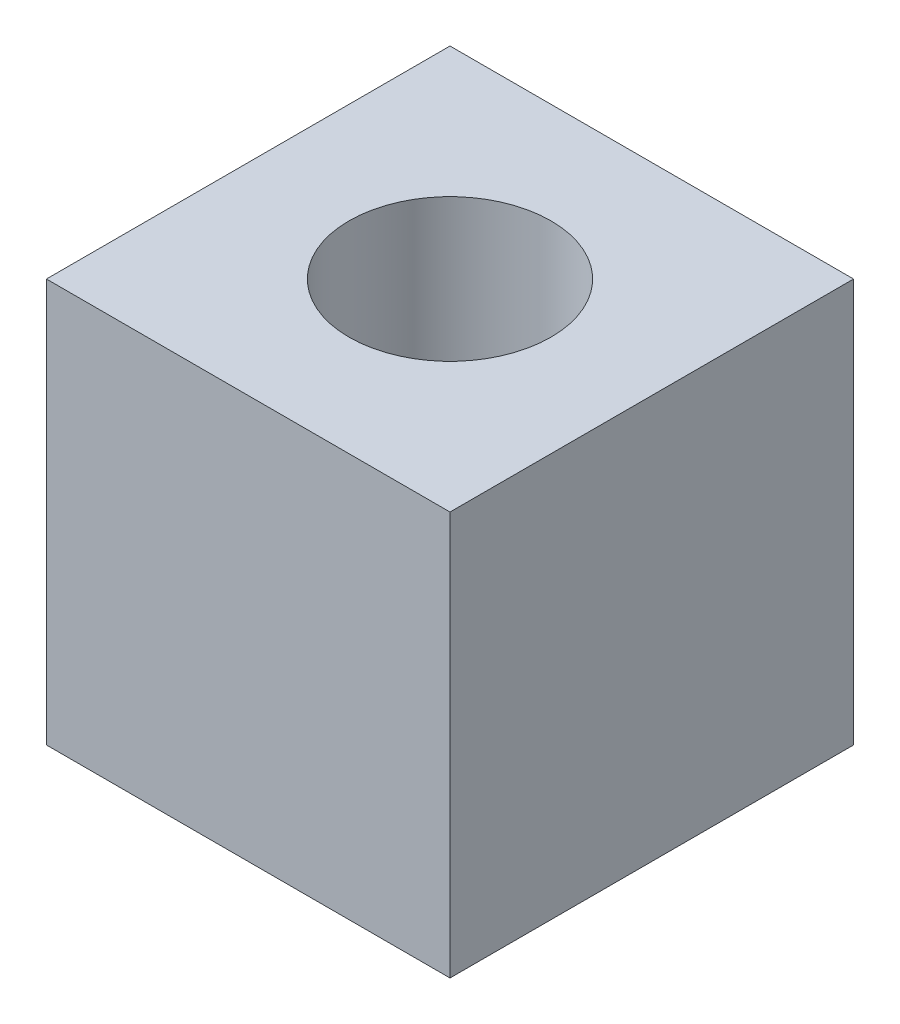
ISO-10303-21;
HEADER;
FILE_DESCRIPTION(('STEP AP214'),'2;1');
FILE_NAME('part.step','',(''),(''),'','','');
FILE_SCHEMA(('AUTOMOTIVE_DESIGN { 1 0 10303 214 1 1 1 1 }'));
ENDSEC;
DATA;
#1=APPLICATION_CONTEXT('core data for automotive mechanical design processes');
#2=APPLICATION_PROTOCOL_DEFINITION('international standard','automotive_design',2000,#1);
#3=PRODUCT_CONTEXT('',#1,'mechanical');
#4=PRODUCT('Part','Part','',(#3));
#5=PRODUCT_RELATED_PRODUCT_CATEGORY('part','',(#4));
#6=PRODUCT_DEFINITION_FORMATION('','',#4);
#7=PRODUCT_DEFINITION_CONTEXT('part definition',#1,'design');
#8=PRODUCT_DEFINITION('design','',#6,#7);
#9=PRODUCT_DEFINITION_SHAPE('','',#8);
#10=(LENGTH_UNIT() NAMED_UNIT(*) SI_UNIT(.MILLI.,.METRE.));
#11=(NAMED_UNIT(*) PLANE_ANGLE_UNIT() SI_UNIT($,.RADIAN.));
#12=(NAMED_UNIT(*) SI_UNIT($,.STERADIAN.) SOLID_ANGLE_UNIT());
#13=UNCERTAINTY_MEASURE_WITH_UNIT(LENGTH_MEASURE(1.E-05),#10,'distance_accuracy_value','');
#14=(GEOMETRIC_REPRESENTATION_CONTEXT(3) GLOBAL_UNCERTAINTY_ASSIGNED_CONTEXT((#13)) GLOBAL_UNIT_ASSIGNED_CONTEXT((#10,
#11,#12)) REPRESENTATION_CONTEXT('',''));
#15=CARTESIAN_POINT('',(0.,0.,0.));
#16=DIRECTION('',(0.,0.,1.));
#17=DIRECTION('',(1.,0.,0.));
#18=AXIS2_PLACEMENT_3D('',#15,#16,#17);
#19=CARTESIAN_POINT('',(0.,0.,101.6));
#20=DIRECTION('',(1.,0.,0.));
#21=DIRECTION('',(0.,0.,-1.));
#22=AXIS2_PLACEMENT_3D('',#19,#20,#21);
#23=PLANE('',#22);
#24=DIRECTION('',(0.,-1.,0.));
#25=VECTOR('',#24,1.);
#26=CARTESIAN_POINT('',(0.,0.,0.));
#27=LINE('',#26,#25);
#28=CARTESIAN_POINT('',(0.,101.6,0.));
#29=VERTEX_POINT('',#28);
#30=CARTESIAN_POINT('',(0.,0.,0.));
#31=VERTEX_POINT('',#30);
#32=EDGE_CURVE('E74',#29,#31,#27,.T.);
#33=ORIENTED_EDGE('',*,*,#32,.T.);
#34=DIRECTION('',(0.,0.,-1.));
#35=VECTOR('',#34,1.);
#36=CARTESIAN_POINT('',(0.,0.,101.6));
#37=LINE('',#36,#35);
#38=CARTESIAN_POINT('',(0.,0.,101.6));
#39=VERTEX_POINT('',#38);
#40=EDGE_CURVE('E11',#39,#31,#37,.T.);
#41=ORIENTED_EDGE('',*,*,#40,.F.);
#42=DIRECTION('',(0.,-1.,0.));
#43=VECTOR('',#42,1.);
#44=CARTESIAN_POINT('',(0.,0.,101.6));
#45=LINE('',#44,#43);
#46=CARTESIAN_POINT('',(0.,101.6,101.6));
#47=VERTEX_POINT('',#46);
#48=EDGE_CURVE('E97',#47,#39,#45,.T.);
#49=ORIENTED_EDGE('',*,*,#48,.F.);
#50=DIRECTION('',(0.,0.,-1.));
#51=VECTOR('',#50,1.);
#52=CARTESIAN_POINT('',(0.,101.6,101.6));
#53=LINE('',#52,#51);
#54=EDGE_CURVE('E86',#47,#29,#53,.T.);
#55=ORIENTED_EDGE('',*,*,#54,.T.);
#56=EDGE_LOOP('',(#33,#41,#49,#55));
#57=FACE_BOUND('',#56,.T.);
#58=ADVANCED_FACE('F30',(#57),#23,.F.);
#59=CARTESIAN_POINT('',(0.,0.,101.6));
#60=DIRECTION('',(0.,1.,0.));
#61=DIRECTION('',(0.,0.,1.));
#62=AXIS2_PLACEMENT_3D('',#59,#60,#61);
#63=PLANE('',#62);
#64=CARTESIAN_POINT('',(50.8,0.,50.8));
#65=DIRECTION('',(0.,1.,0.));
#66=DIRECTION('',(0.,0.,1.));
#67=AXIS2_PLACEMENT_3D('',#64,#65,#66);
#68=CIRCLE('',#67,25.4);
#69=CARTESIAN_POINT('',(50.8,0.,76.2));
#70=VERTEX_POINT('',#69);
#71=EDGE_CURVE('E87',#70,#70,#68,.T.);
#72=ORIENTED_EDGE('',*,*,#71,.T.);
#73=EDGE_LOOP('',(#72));
#74=FACE_BOUND('',#73,.T.);
#75=DIRECTION('',(1.,0.,0.));
#76=VECTOR('',#75,1.);
#77=CARTESIAN_POINT('',(0.,0.,0.));
#78=LINE('',#77,#76);
#79=CARTESIAN_POINT('',(101.6,0.,0.));
#80=VERTEX_POINT('',#79);
#81=EDGE_CURVE('E70',#31,#80,#78,.T.);
#82=ORIENTED_EDGE('',*,*,#81,.T.);
#83=DIRECTION('',(0.,0.,-1.));
#84=VECTOR('',#83,1.);
#85=CARTESIAN_POINT('',(101.6,0.,101.6));
#86=LINE('',#85,#84);
#87=CARTESIAN_POINT('',(101.6,0.,101.6));
#88=VERTEX_POINT('',#87);
#89=EDGE_CURVE('E37',#88,#80,#86,.T.);
#90=ORIENTED_EDGE('',*,*,#89,.F.);
#91=DIRECTION('',(1.,0.,0.));
#92=VECTOR('',#91,1.);
#93=CARTESIAN_POINT('',(0.,0.,101.6));
#94=LINE('',#93,#92);
#95=EDGE_CURVE('E82',#39,#88,#94,.T.);
#96=ORIENTED_EDGE('',*,*,#95,.F.);
#97=ORIENTED_EDGE('',*,*,#40,.T.);
#98=EDGE_LOOP('',(#82,#90,#96,#97));
#99=FACE_BOUND('',#98,.T.);
#100=ADVANCED_FACE('F81',(#74,#99),#63,.F.);
#101=CARTESIAN_POINT('',(101.6,0.,101.6));
#102=DIRECTION('',(-1.,0.,0.));
#103=DIRECTION('',(0.,-1.,0.));
#104=AXIS2_PLACEMENT_3D('',#101,#102,#103);
#105=PLANE('',#104);
#106=DIRECTION('',(0.,1.,0.));
#107=VECTOR('',#106,1.);
#108=CARTESIAN_POINT('',(101.6,0.,0.));
#109=LINE('',#108,#107);
#110=CARTESIAN_POINT('',(101.6,101.6,0.));
#111=VERTEX_POINT('',#110);
#112=EDGE_CURVE('E75',#80,#111,#109,.T.);
#113=ORIENTED_EDGE('',*,*,#112,.T.);
#114=DIRECTION('',(0.,0.,-1.));
#115=VECTOR('',#114,1.);
#116=CARTESIAN_POINT('',(101.6,101.6,101.6));
#117=LINE('',#116,#115);
#118=CARTESIAN_POINT('',(101.6,101.6,101.6));
#119=VERTEX_POINT('',#118);
#120=EDGE_CURVE('E103',#119,#111,#117,.T.);
#121=ORIENTED_EDGE('',*,*,#120,.F.);
#122=DIRECTION('',(0.,1.,0.));
#123=VECTOR('',#122,1.);
#124=CARTESIAN_POINT('',(101.6,0.,101.6));
#125=LINE('',#124,#123);
#126=EDGE_CURVE('E49',#88,#119,#125,.T.);
#127=ORIENTED_EDGE('',*,*,#126,.F.);
#128=ORIENTED_EDGE('',*,*,#89,.T.);
#129=EDGE_LOOP('',(#113,#121,#127,#128));
#130=FACE_BOUND('',#129,.T.);
#131=ADVANCED_FACE('F106',(#130),#105,.F.);
#132=CARTESIAN_POINT('',(0.,101.6,101.6));
#133=DIRECTION('',(0.,-1.,0.));
#134=DIRECTION('',(0.,0.,-1.));
#135=AXIS2_PLACEMENT_3D('',#132,#133,#134);
#136=PLANE('',#135);
#137=CARTESIAN_POINT('',(50.8,101.6,50.8));
#138=DIRECTION('',(0.,1.,0.));
#139=DIRECTION('',(0.,0.,1.));
#140=AXIS2_PLACEMENT_3D('',#137,#138,#139);
#141=CIRCLE('',#140,25.4);
#142=CARTESIAN_POINT('',(50.8,101.6,76.2));
#143=VERTEX_POINT('',#142);
#144=EDGE_CURVE('E90',#143,#143,#141,.T.);
#145=ORIENTED_EDGE('',*,*,#144,.F.);
#146=EDGE_LOOP('',(#145));
#147=FACE_BOUND('',#146,.T.);
#148=DIRECTION('',(-1.,0.,0.));
#149=VECTOR('',#148,1.);
#150=CARTESIAN_POINT('',(0.,101.6,0.));
#151=LINE('',#150,#149);
#152=EDGE_CURVE('E95',#111,#29,#151,.T.);
#153=ORIENTED_EDGE('',*,*,#152,.T.);
#154=ORIENTED_EDGE('',*,*,#54,.F.);
#155=DIRECTION('',(-1.,0.,0.));
#156=VECTOR('',#155,1.);
#157=CARTESIAN_POINT('',(0.,101.6,101.6));
#158=LINE('',#157,#156);
#159=EDGE_CURVE('E44',#119,#47,#158,.T.);
#160=ORIENTED_EDGE('',*,*,#159,.F.);
#161=ORIENTED_EDGE('',*,*,#120,.T.);
#162=EDGE_LOOP('',(#153,#154,#160,#161));
#163=FACE_BOUND('',#162,.T.);
#164=ADVANCED_FACE('F108',(#147,#163),#136,.F.);
#165=CARTESIAN_POINT('',(0.,101.6,101.6));
#166=DIRECTION('',(0.,0.,-1.));
#167=DIRECTION('',(-1.,0.,0.));
#168=AXIS2_PLACEMENT_3D('',#165,#166,#167);
#169=PLANE('',#168);
#170=ORIENTED_EDGE('',*,*,#48,.T.);
#171=ORIENTED_EDGE('',*,*,#95,.T.);
#172=ORIENTED_EDGE('',*,*,#126,.T.);
#173=ORIENTED_EDGE('',*,*,#159,.T.);
#174=EDGE_LOOP('',(#170,#171,#172,#173));
#175=FACE_BOUND('',#174,.T.);
#176=ADVANCED_FACE('F109',(#175),#169,.F.);
#177=CARTESIAN_POINT('',(0.,101.6,0.));
#178=DIRECTION('',(0.,0.,-1.));
#179=DIRECTION('',(-1.,0.,0.));
#180=AXIS2_PLACEMENT_3D('',#177,#178,#179);
#181=PLANE('',#180);
#182=ORIENTED_EDGE('',*,*,#32,.F.);
#183=ORIENTED_EDGE('',*,*,#152,.F.);
#184=ORIENTED_EDGE('',*,*,#112,.F.);
#185=ORIENTED_EDGE('',*,*,#81,.F.);
#186=EDGE_LOOP('',(#182,#183,#184,#185));
#187=FACE_BOUND('',#186,.T.);
#188=ADVANCED_FACE('F71',(#187),#181,.T.);
#189=CARTESIAN_POINT('',(50.8,0.,50.8));
#190=DIRECTION('',(0.,1.,0.));
#191=DIRECTION('',(0.,0.,1.));
#192=AXIS2_PLACEMENT_3D('',#189,#190,#191);
#193=CYLINDRICAL_SURFACE('',#192,25.4);
#194=ORIENTED_EDGE('',*,*,#71,.F.);
#195=EDGE_LOOP('',(#194));
#196=FACE_BOUND('',#195,.T.);
#197=ORIENTED_EDGE('',*,*,#144,.T.);
#198=EDGE_LOOP('',(#197));
#199=FACE_BOUND('',#198,.T.);
#200=ADVANCED_FACE('F116',(#196,#199),#193,.F.);
#201=CLOSED_SHELL('',(#58,#100,#131,#164,#176,#188,#200));
#202=MANIFOLD_SOLID_BREP('B2',#201);
#203=ADVANCED_BREP_SHAPE_REPRESENTATION('',(#18,#202),#14);
#204=SHAPE_DEFINITION_REPRESENTATION(#9,#203);
ENDSEC;
END-ISO-10303-21;
